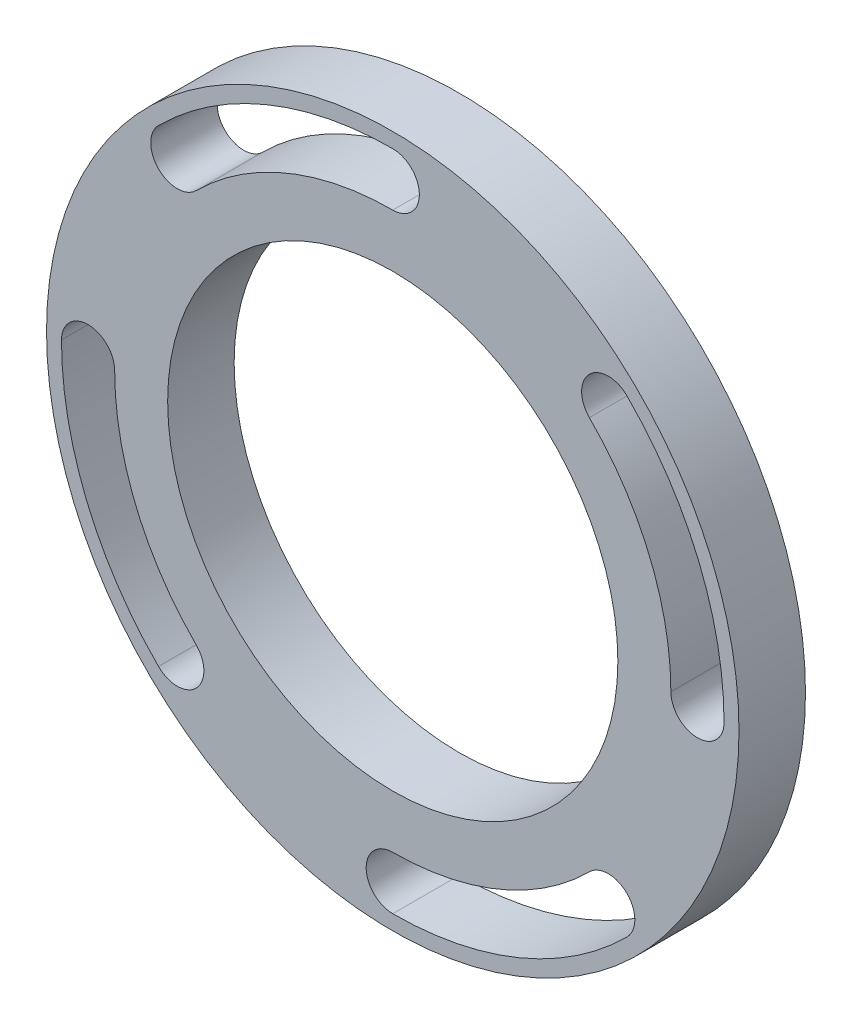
from build123d import *

# Parameters (mm, degrees)
CUT_EXTRUDE1_DEPTH = 34.984901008
CIRPATTERN1_COUNT  = 4


with BuildPart() as part:
    # Sketch1 → Revolve1 (revolve)
    with BuildSketch(Plane(origin=(0, 0, 0), x_dir=(0, 0, -1), z_dir=(1, 0, 0)), mode=Mode.PRIVATE) as revolve1_sk:
        Polygon((0.508, 23.8125), (0.508, 18.415), (0.508, 15.4813), (5.08, 15.4813), (5.08, 23.8125), align=None)
    revolve(revolve1_sk.sketch.rotate(Axis((0, 0, 5.032300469), (0, 0, -1)), 90), axis=Axis((0, 0, 5.032300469), (0, 0, -1)))

    # Sketch2 → Cut-Extrude1 (cut, through all)
    with BuildSketch(Plane(origin=(0, 0, -5.08), x_dir=(-1, 0, 0), z_dir=(0, 0, -1))):
        with BuildLine():
            ThreePointArc((16.110579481, 16.110579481), (8.718982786, 21.049486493), (0, 22.7838))
            ThreePointArc((0, 22.7838), (-1.8288, 20.955), (0, 19.1262))
            ThreePointArc((0, 19.1262), (7.319279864, 17.670304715), (13.524265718, 13.524265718))
            ThreePointArc((13.524265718, 13.524265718), (16.110579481, 13.524265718), (16.110579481, 16.110579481))
        make_face()
    cut_extrude1 = extrude(amount=-CUT_EXTRUDE1_DEPTH, mode=Mode.SUBTRACT)

    # CirPattern1: Cut-Extrude1 ×4 about axis
    cirpattern1_axis = Axis((0, 0, 0), (0, 0, 1))
    for i in range(1, CIRPATTERN1_COUNT):
        add(cut_extrude1.rotate(cirpattern1_axis, i * 360 / CIRPATTERN1_COUNT), mode=Mode.SUBTRACT)


solid = part.part
